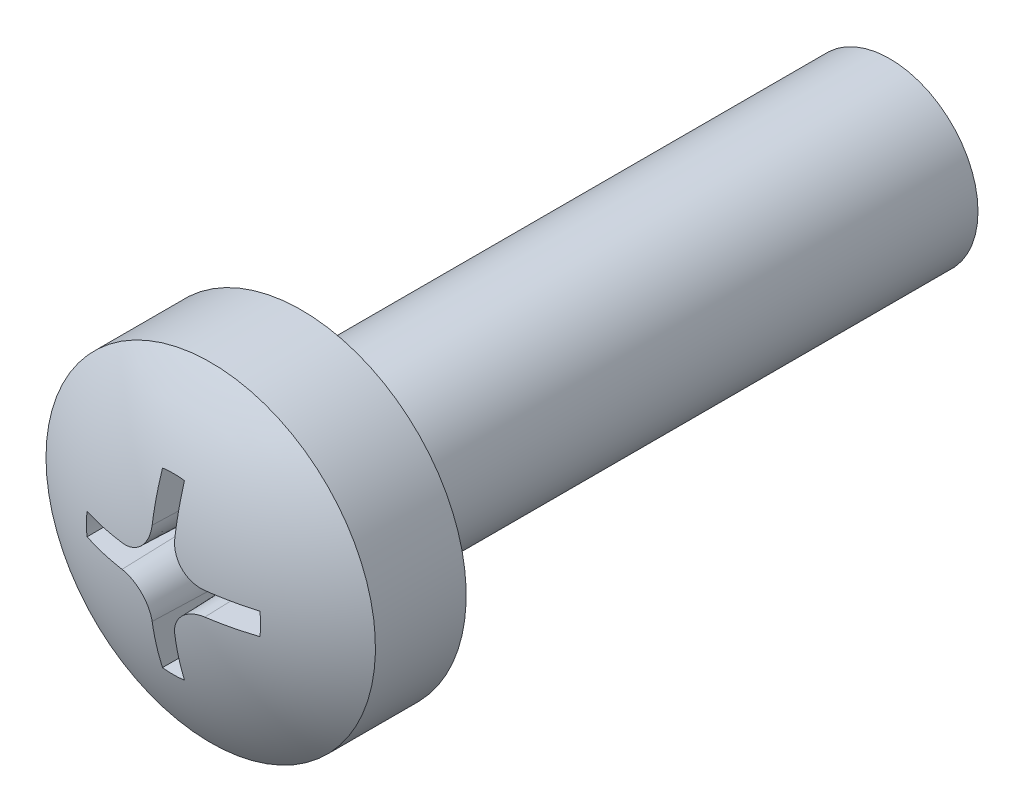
from build123d import *

# Parameters (mm, degrees)
SKETCH1_R          = 1.5
BASE_EXTRUDE_DEPTH = 10
CUT_EXTRUDE1_DEPTH = 1.799999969
CUT_EXTRUDE1_TAPER = 2


with BuildPart() as part:
    # Sketch1 → Base-Extrude (new body)
    with BuildSketch(Plane.XY):
        Circle(SKETCH1_R)
    extrude(amount=BASE_EXTRUDE_DEPTH)

    # Sketch6 → Boss-Revolve2 (revolve)
    with BuildSketch(Plane(origin=(0, 0, 0), x_dir=(1, 0, 0), z_dir=(0, 1, 0)), mode=Mode.PRIVATE) as boss_revolve2_sk:
        with BuildLine():
            Line((0, -10), (2.7999999, -10))
            Line((2.7999999, -10), (2.7999999, -11.54246308))
            ThreePointArc((2.7999999, -11.54246308), (1.46418655, -12.180811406), (0, -12.4))
            Line((0, -12.4), (0, -10))
        make_face()
    revolve(boss_revolve2_sk.sketch.rotate(Axis((0, 0, -0.393620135), (0, 0, 1)), 180), axis=Axis((0, 0, -0.393620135), (0, 0, 1)))

    # Sketch7 → Cut-Extrude1 (cut)
    with BuildSketch(Plane(origin=(0, 0, 12.7000001), x_dir=(-1, 0, 0), z_dir=(0, 0, -1))):
        with BuildLine():
            ThreePointArc((0.205000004, 1.48592565), (0, 1.500000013), (-0.205000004, 1.48592565))
            Line((-0.205000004, 1.48592565), (-0.205000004, 0.708178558))
            ThreePointArc((-0.205000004, 0.708178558), (-0.35072876, 0.355344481), (-0.702967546, 0.208182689))
            Line((-0.702967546, 0.208182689), (-1.48592565, 0.205000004))
            ThreePointArc((-1.48592565, 0.205000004), (-1.500000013, 0), (-1.48592565, -0.205000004))
            Line((-1.48592565, -0.205000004), (-0.702967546, -0.208182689))
            ThreePointArc((-0.702967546, -0.208182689), (-0.35072876, -0.355344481), (-0.205000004, -0.708178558))
            Line((-0.205000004, -0.708178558), (-0.205000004, -1.48592565))
            ThreePointArc((-0.205000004, -1.48592565), (0, -1.500000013), (0.205000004, -1.48592565))
            Line((0.205000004, -1.48592565), (0.205000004, -0.708178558))
            ThreePointArc((0.205000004, -0.708178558), (0.35072876, -0.355344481), (0.702967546, -0.208182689))
            Line((0.702967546, -0.208182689), (1.48592565, -0.205000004))
            ThreePointArc((1.48592565, -0.205000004), (1.500000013, 0), (1.48592565, 0.205000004))
            Line((1.48592565, 0.205000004), (0.702967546, 0.208182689))
            ThreePointArc((0.702967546, 0.208182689), (0.35072876, 0.355344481), (0.205000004, 0.708178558))
            Line((0.205000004, 0.708178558), (0.205000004, 1.48592565))
        make_face()
    extrude(amount=CUT_EXTRUDE1_DEPTH, taper=CUT_EXTRUDE1_TAPER, mode=Mode.SUBTRACT)


solid = part.part
